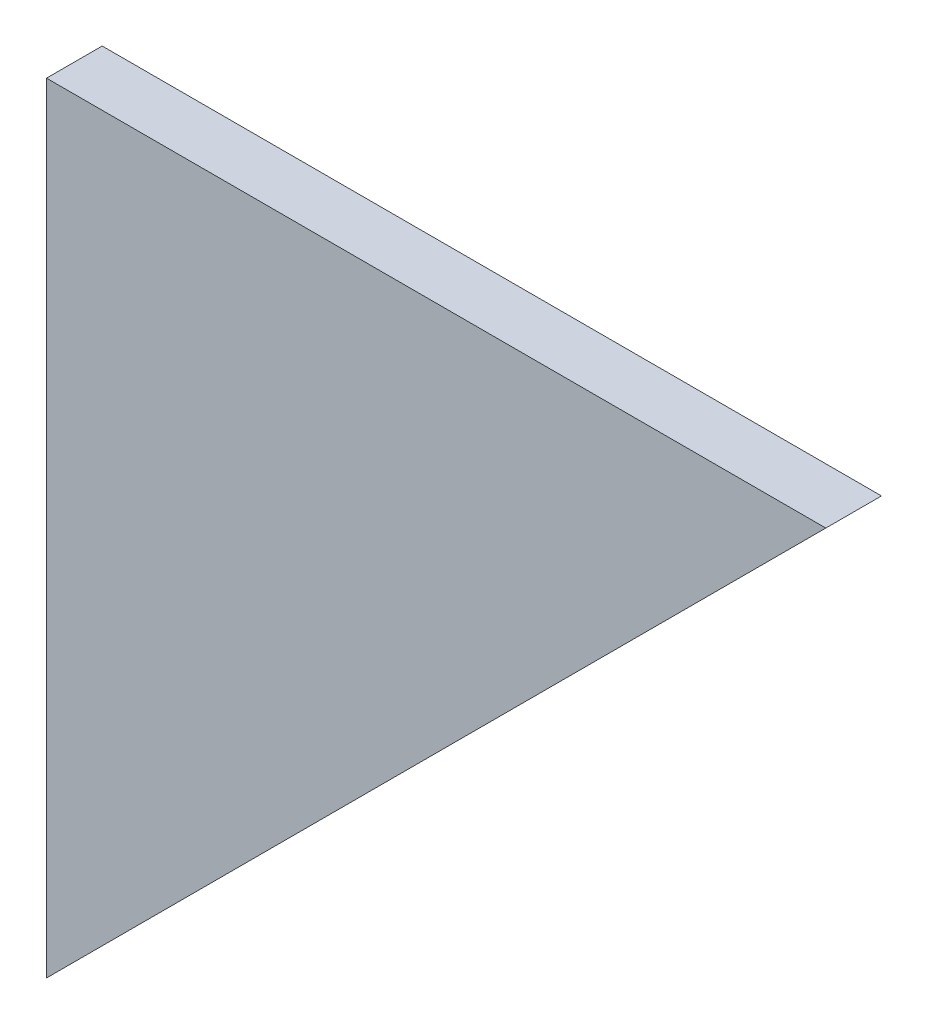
from build123d import *

# Parameters (mm, degrees)
BASE_EXTRUSION_DEPTH = 5


with BuildPart() as part:
    # Esquisse1 → Base-Extrusion (new body)
    with BuildSketch(Plane.XY):
        Polygon((70, 0), (0, -70), (0, 0), align=None)
    extrude(amount=BASE_EXTRUSION_DEPTH)


solid = part.part
